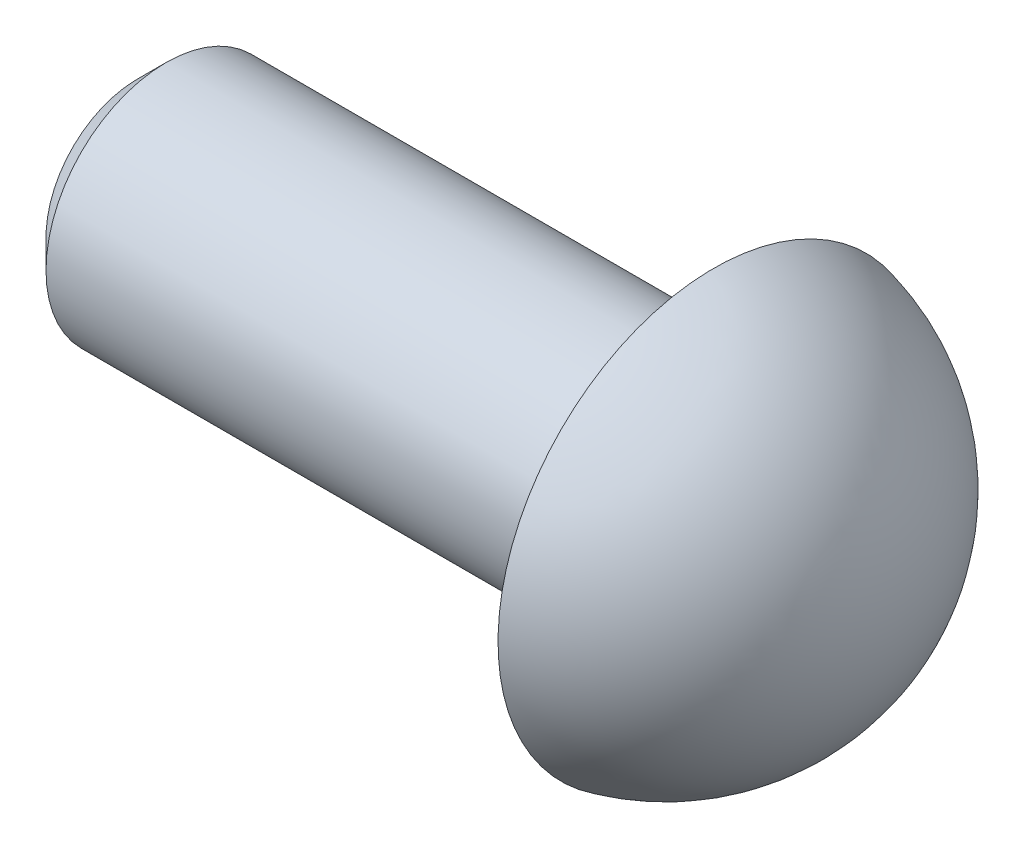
from build123d import *

# Parameters (mm, degrees)
CHANFREIN1_SIZE = 0.3


with BuildPart() as part:
    # Esquisse2 → R_volution2 (revolve)
    with BuildSketch(Plane.XY):
        with BuildLine():
            Line((0, -2.244994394), (0, -1.25))
            Line((0, -1.25), (-6, -1.25))
            Line((-6, -1.25), (-6, 0))
            Line((-6, 0), (1.8, 0))
            ThreePointArc((1.8, 0), (1.294435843, -1.438749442), (0, -2.244994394))
        make_face()
    revolve(axis=Axis((1.823030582, 0, 0), (-1, 0, 0)))

    # Chanfrein1
    chanfrein1_edges = [part.edges().sort_by_distance(p)[0] for p in [
        (-6, 1.25, 0),
    ]]
    chamfer(chanfrein1_edges, length=CHANFREIN1_SIZE)


solid = part.part
